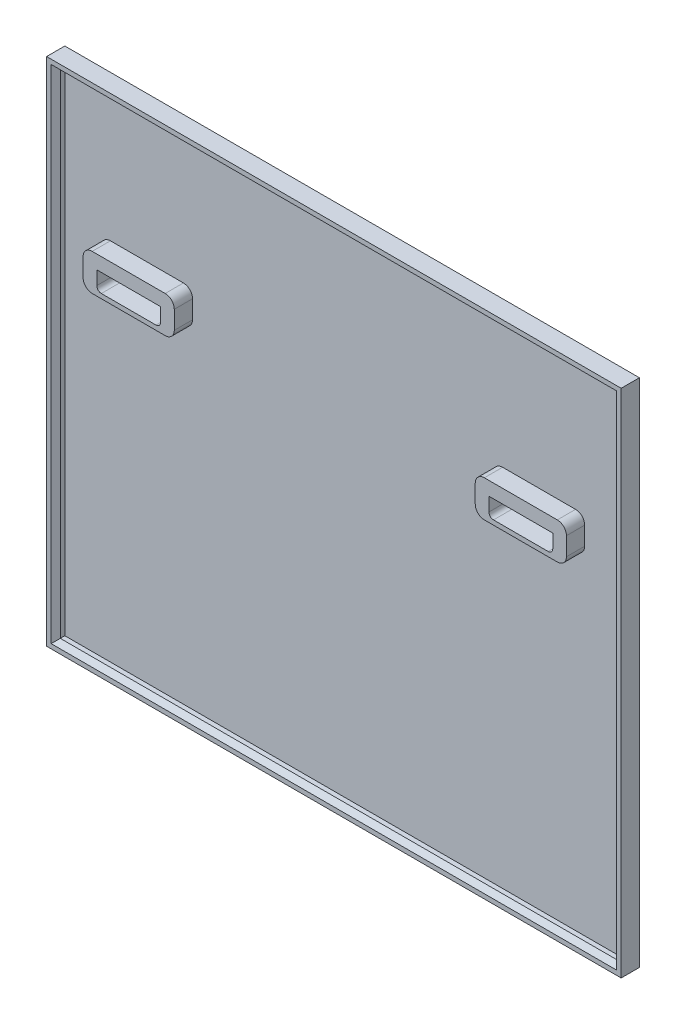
ISO-10303-21;
HEADER;
FILE_DESCRIPTION(('STEP AP214'),'2;1');
FILE_NAME('part.step','',(''),(''),'','','');
FILE_SCHEMA(('AUTOMOTIVE_DESIGN { 1 0 10303 214 1 1 1 1 }'));
ENDSEC;
DATA;
#1=APPLICATION_CONTEXT('core data for automotive mechanical design processes');
#2=APPLICATION_PROTOCOL_DEFINITION('international standard','automotive_design',2000,#1);
#3=PRODUCT_CONTEXT('',#1,'mechanical');
#4=PRODUCT('Part','Part','',(#3));
#5=PRODUCT_RELATED_PRODUCT_CATEGORY('part','',(#4));
#6=PRODUCT_DEFINITION_FORMATION('','',#4);
#7=PRODUCT_DEFINITION_CONTEXT('part definition',#1,'design');
#8=PRODUCT_DEFINITION('design','',#6,#7);
#9=PRODUCT_DEFINITION_SHAPE('','',#8);
#10=(LENGTH_UNIT() NAMED_UNIT(*) SI_UNIT(.MILLI.,.METRE.));
#11=(NAMED_UNIT(*) PLANE_ANGLE_UNIT() SI_UNIT($,.RADIAN.));
#12=(NAMED_UNIT(*) SI_UNIT($,.STERADIAN.) SOLID_ANGLE_UNIT());
#13=UNCERTAINTY_MEASURE_WITH_UNIT(LENGTH_MEASURE(1.E-05),#10,'distance_accuracy_value','');
#14=(GEOMETRIC_REPRESENTATION_CONTEXT(3) GLOBAL_UNCERTAINTY_ASSIGNED_CONTEXT((#13)) GLOBAL_UNIT_ASSIGNED_CONTEXT((#10,
#11,#12)) REPRESENTATION_CONTEXT('',''));
#15=CARTESIAN_POINT('',(0.,0.,0.));
#16=DIRECTION('',(0.,0.,1.));
#17=DIRECTION('',(1.,0.,0.));
#18=AXIS2_PLACEMENT_3D('',#15,#16,#17);
#19=CARTESIAN_POINT('',(0.,-560.,10.));
#20=DIRECTION('',(0.,0.,1.));
#21=DIRECTION('',(1.,0.,0.));
#22=AXIS2_PLACEMENT_3D('',#19,#20,#21);
#23=PLANE('',#22);
#24=DIRECTION('',(0.,1.,0.));
#25=VECTOR('',#24,1.);
#26=CARTESIAN_POINT('',(150.,-160.,10.));
#27=LINE('',#26,#25);
#28=CARTESIAN_POINT('',(150.,-180.,10.));
#29=VERTEX_POINT('',#28);
#30=CARTESIAN_POINT('',(150.,-160.,10.));
#31=VERTEX_POINT('',#30);
#32=EDGE_CURVE('E480',#29,#31,#27,.T.);
#33=ORIENTED_EDGE('',*,*,#32,.F.);
#34=CARTESIAN_POINT('',(140.,-180.,10.));
#35=DIRECTION('',(0.,0.,1.));
#36=DIRECTION('',(-1.,0.,0.));
#37=AXIS2_PLACEMENT_3D('',#34,#35,#36);
#38=CIRCLE('',#37,9.99999999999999);
#39=CARTESIAN_POINT('',(140.,-190.,10.));
#40=VERTEX_POINT('',#39);
#41=EDGE_CURVE('E458',#40,#29,#38,.T.);
#42=ORIENTED_EDGE('',*,*,#41,.F.);
#43=DIRECTION('',(1.,0.,0.));
#44=VECTOR('',#43,1.);
#45=CARTESIAN_POINT('',(60.,-190.,10.));
#46=LINE('',#45,#44);
#47=CARTESIAN_POINT('',(60.,-190.,10.));
#48=VERTEX_POINT('',#47);
#49=EDGE_CURVE('E463',#48,#40,#46,.T.);
#50=ORIENTED_EDGE('',*,*,#49,.F.);
#51=CARTESIAN_POINT('',(60.,-180.,10.));
#52=DIRECTION('',(0.,0.,1.));
#53=DIRECTION('',(1.,0.,0.));
#54=AXIS2_PLACEMENT_3D('',#51,#52,#53);
#55=CIRCLE('',#54,10.);
#56=CARTESIAN_POINT('',(50.,-180.,10.));
#57=VERTEX_POINT('',#56);
#58=EDGE_CURVE('E490',#57,#48,#55,.T.);
#59=ORIENTED_EDGE('',*,*,#58,.F.);
#60=DIRECTION('',(0.,-1.,0.));
#61=VECTOR('',#60,1.);
#62=CARTESIAN_POINT('',(50.,-160.,10.));
#63=LINE('',#62,#61);
#64=CARTESIAN_POINT('',(50.,-160.,10.));
#65=VERTEX_POINT('',#64);
#66=EDGE_CURVE('E488',#65,#57,#63,.T.);
#67=ORIENTED_EDGE('',*,*,#66,.F.);
#68=CARTESIAN_POINT('',(60.,-160.,10.));
#69=DIRECTION('',(0.,0.,1.));
#70=DIRECTION('',(1.,0.,0.));
#71=AXIS2_PLACEMENT_3D('',#68,#69,#70);
#72=CIRCLE('',#71,10.);
#73=CARTESIAN_POINT('',(60.,-150.,10.));
#74=VERTEX_POINT('',#73);
#75=EDGE_CURVE('E486',#74,#65,#72,.T.);
#76=ORIENTED_EDGE('',*,*,#75,.F.);
#77=DIRECTION('',(-1.,0.,0.));
#78=VECTOR('',#77,1.);
#79=CARTESIAN_POINT('',(60.,-150.,10.));
#80=LINE('',#79,#78);
#81=CARTESIAN_POINT('',(140.,-150.,10.));
#82=VERTEX_POINT('',#81);
#83=EDGE_CURVE('E484',#82,#74,#80,.T.);
#84=ORIENTED_EDGE('',*,*,#83,.F.);
#85=CARTESIAN_POINT('',(140.,-160.,10.));
#86=DIRECTION('',(0.,0.,1.));
#87=DIRECTION('',(1.,0.,0.));
#88=AXIS2_PLACEMENT_3D('',#85,#86,#87);
#89=CIRCLE('',#88,10.);
#90=EDGE_CURVE('E482',#31,#82,#89,.T.);
#91=ORIENTED_EDGE('',*,*,#90,.F.);
#92=EDGE_LOOP('',(#33,#42,#50,#59,#67,#76,#84,#91));
#93=FACE_BOUND('',#92,.T.);
#94=DIRECTION('',(0.,-1.,0.));
#95=VECTOR('',#94,1.);
#96=CARTESIAN_POINT('',(10.,0.,10.));
#97=LINE('',#96,#95);
#98=CARTESIAN_POINT('',(10.,-10.,10.));
#99=VERTEX_POINT('',#98);
#100=CARTESIAN_POINT('',(10.0000000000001,-550.,10.));
#101=VERTEX_POINT('',#100);
#102=EDGE_CURVE('E548',#99,#101,#97,.T.);
#103=ORIENTED_EDGE('',*,*,#102,.T.);
#104=DIRECTION('',(1.,0.,0.));
#105=VECTOR('',#104,1.);
#106=CARTESIAN_POINT('',(0.,-550.,10.));
#107=LINE('',#106,#105);
#108=CARTESIAN_POINT('',(620.,-550.,10.));
#109=VERTEX_POINT('',#108);
#110=EDGE_CURVE('E551',#101,#109,#107,.T.);
#111=ORIENTED_EDGE('',*,*,#110,.T.);
#112=DIRECTION('',(0.,1.,0.));
#113=VECTOR('',#112,1.);
#114=CARTESIAN_POINT('',(620.,0.,10.));
#115=LINE('',#114,#113);
#116=CARTESIAN_POINT('',(620.,-10.,10.));
#117=VERTEX_POINT('',#116);
#118=EDGE_CURVE('E562',#109,#117,#115,.T.);
#119=ORIENTED_EDGE('',*,*,#118,.T.);
#120=DIRECTION('',(-1.,0.,0.));
#121=VECTOR('',#120,1.);
#122=CARTESIAN_POINT('',(0.,-10.,10.));
#123=LINE('',#122,#121);
#124=EDGE_CURVE('E559',#117,#99,#123,.T.);
#125=ORIENTED_EDGE('',*,*,#124,.T.);
#126=EDGE_LOOP('',(#103,#111,#119,#125));
#127=FACE_BOUND('',#126,.T.);
#128=DIRECTION('',(0.,1.,0.));
#129=VECTOR('',#128,1.);
#130=CARTESIAN_POINT('',(580.,-160.,10.));
#131=LINE('',#130,#129);
#132=CARTESIAN_POINT('',(580.,-180.,10.));
#133=VERTEX_POINT('',#132);
#134=CARTESIAN_POINT('',(580.,-160.,10.));
#135=VERTEX_POINT('',#134);
#136=EDGE_CURVE('E423',#133,#135,#131,.T.);
#137=ORIENTED_EDGE('',*,*,#136,.F.);
#138=CARTESIAN_POINT('',(570.,-180.,10.));
#139=DIRECTION('',(0.,0.,1.));
#140=DIRECTION('',(-1.,0.,0.));
#141=AXIS2_PLACEMENT_3D('',#138,#139,#140);
#142=CIRCLE('',#141,9.99999999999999);
#143=CARTESIAN_POINT('',(570.,-190.,10.));
#144=VERTEX_POINT('',#143);
#145=EDGE_CURVE('E392',#144,#133,#142,.T.);
#146=ORIENTED_EDGE('',*,*,#145,.F.);
#147=DIRECTION('',(1.,0.,0.));
#148=VECTOR('',#147,1.);
#149=CARTESIAN_POINT('',(490.,-190.,10.));
#150=LINE('',#149,#148);
#151=CARTESIAN_POINT('',(490.,-190.,10.));
#152=VERTEX_POINT('',#151);
#153=EDGE_CURVE('E406',#152,#144,#150,.T.);
#154=ORIENTED_EDGE('',*,*,#153,.F.);
#155=CARTESIAN_POINT('',(490.,-180.,10.));
#156=DIRECTION('',(0.,0.,1.));
#157=DIRECTION('',(1.,0.,0.));
#158=AXIS2_PLACEMENT_3D('',#155,#156,#157);
#159=CIRCLE('',#158,9.99999999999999);
#160=CARTESIAN_POINT('',(480.,-180.,10.));
#161=VERTEX_POINT('',#160);
#162=EDGE_CURVE('E433',#161,#152,#159,.T.);
#163=ORIENTED_EDGE('',*,*,#162,.F.);
#164=DIRECTION('',(0.,-1.,0.));
#165=VECTOR('',#164,1.);
#166=CARTESIAN_POINT('',(480.,-160.,10.));
#167=LINE('',#166,#165);
#168=CARTESIAN_POINT('',(480.,-160.,10.));
#169=VERTEX_POINT('',#168);
#170=EDGE_CURVE('E431',#169,#161,#167,.T.);
#171=ORIENTED_EDGE('',*,*,#170,.F.);
#172=CARTESIAN_POINT('',(490.,-160.,10.));
#173=DIRECTION('',(0.,0.,1.));
#174=DIRECTION('',(-1.,0.,0.));
#175=AXIS2_PLACEMENT_3D('',#172,#173,#174);
#176=CIRCLE('',#175,10.);
#177=CARTESIAN_POINT('',(490.,-150.,10.));
#178=VERTEX_POINT('',#177);
#179=EDGE_CURVE('E429',#178,#169,#176,.T.);
#180=ORIENTED_EDGE('',*,*,#179,.F.);
#181=DIRECTION('',(-1.,0.,0.));
#182=VECTOR('',#181,1.);
#183=CARTESIAN_POINT('',(490.,-150.,10.));
#184=LINE('',#183,#182);
#185=CARTESIAN_POINT('',(570.,-150.,10.));
#186=VERTEX_POINT('',#185);
#187=EDGE_CURVE('E427',#186,#178,#184,.T.);
#188=ORIENTED_EDGE('',*,*,#187,.F.);
#189=CARTESIAN_POINT('',(570.,-160.,10.));
#190=DIRECTION('',(0.,0.,1.));
#191=DIRECTION('',(1.,0.,0.));
#192=AXIS2_PLACEMENT_3D('',#189,#190,#191);
#193=CIRCLE('',#192,10.);
#194=EDGE_CURVE('E425',#135,#186,#193,.T.);
#195=ORIENTED_EDGE('',*,*,#194,.F.);
#196=EDGE_LOOP('',(#137,#146,#154,#163,#171,#180,#188,#195));
#197=FACE_BOUND('',#196,.T.);
#198=ADVANCED_FACE('F31',(#93,#127,#197),#23,.T.);
#199=CARTESIAN_POINT('',(0.,0.,20.));
#200=DIRECTION('',(1.,0.,0.));
#201=DIRECTION('',(0.,1.,0.));
#202=AXIS2_PLACEMENT_3D('',#199,#200,#201);
#203=PLANE('',#202);
#204=DIRECTION('',(0.,-1.,0.));
#205=VECTOR('',#204,1.);
#206=CARTESIAN_POINT('',(0.,0.,0.));
#207=LINE('',#206,#205);
#208=CARTESIAN_POINT('',(0.,0.,0.));
#209=VERTEX_POINT('',#208);
#210=CARTESIAN_POINT('',(0.,-560.,0.));
#211=VERTEX_POINT('',#210);
#212=EDGE_CURVE('E554',#209,#211,#207,.T.);
#213=ORIENTED_EDGE('',*,*,#212,.T.);
#214=DIRECTION('',(0.,0.,-1.));
#215=VECTOR('',#214,1.);
#216=CARTESIAN_POINT('',(0.,-560.,20.));
#217=LINE('',#216,#215);
#218=CARTESIAN_POINT('',(0.,-560.,20.));
#219=VERTEX_POINT('',#218);
#220=EDGE_CURVE('E595',#219,#211,#217,.T.);
#221=ORIENTED_EDGE('',*,*,#220,.F.);
#222=DIRECTION('',(0.,-1.,0.));
#223=VECTOR('',#222,1.);
#224=CARTESIAN_POINT('',(0.,0.,20.));
#225=LINE('',#224,#223);
#226=CARTESIAN_POINT('',(0.,0.,20.));
#227=VERTEX_POINT('',#226);
#228=EDGE_CURVE('E569',#227,#219,#225,.T.);
#229=ORIENTED_EDGE('',*,*,#228,.F.);
#230=DIRECTION('',(0.,0.,-1.));
#231=VECTOR('',#230,1.);
#232=CARTESIAN_POINT('',(0.,0.,20.));
#233=LINE('',#232,#231);
#234=EDGE_CURVE('E579',#227,#209,#233,.T.);
#235=ORIENTED_EDGE('',*,*,#234,.T.);
#236=EDGE_LOOP('',(#213,#221,#229,#235));
#237=FACE_BOUND('',#236,.T.);
#238=ADVANCED_FACE('F670',(#237),#203,.F.);
#239=CARTESIAN_POINT('',(0.,-560.,20.));
#240=DIRECTION('',(0.,1.,0.));
#241=DIRECTION('',(0.,0.,1.));
#242=AXIS2_PLACEMENT_3D('',#239,#240,#241);
#243=PLANE('',#242);
#244=DIRECTION('',(1.,0.,0.));
#245=VECTOR('',#244,1.);
#246=CARTESIAN_POINT('',(0.,-560.,0.));
#247=LINE('',#246,#245);
#248=CARTESIAN_POINT('',(630.,-560.,0.));
#249=VERTEX_POINT('',#248);
#250=EDGE_CURVE('E582',#211,#249,#247,.T.);
#251=ORIENTED_EDGE('',*,*,#250,.T.);
#252=DIRECTION('',(0.,0.,-1.));
#253=VECTOR('',#252,1.);
#254=CARTESIAN_POINT('',(630.,-560.,20.));
#255=LINE('',#254,#253);
#256=CARTESIAN_POINT('',(630.,-560.,20.));
#257=VERTEX_POINT('',#256);
#258=EDGE_CURVE('E592',#257,#249,#255,.T.);
#259=ORIENTED_EDGE('',*,*,#258,.F.);
#260=DIRECTION('',(1.,0.,0.));
#261=VECTOR('',#260,1.);
#262=CARTESIAN_POINT('',(0.,-560.,20.));
#263=LINE('',#262,#261);
#264=EDGE_CURVE('E572',#219,#257,#263,.T.);
#265=ORIENTED_EDGE('',*,*,#264,.F.);
#266=ORIENTED_EDGE('',*,*,#220,.T.);
#267=EDGE_LOOP('',(#251,#259,#265,#266));
#268=FACE_BOUND('',#267,.T.);
#269=ADVANCED_FACE('F676',(#268),#243,.F.);
#270=CARTESIAN_POINT('',(630.,0.,20.));
#271=DIRECTION('',(-1.,0.,0.));
#272=DIRECTION('',(0.,-1.,0.));
#273=AXIS2_PLACEMENT_3D('',#270,#271,#272);
#274=PLANE('',#273);
#275=DIRECTION('',(0.,1.,0.));
#276=VECTOR('',#275,1.);
#277=CARTESIAN_POINT('',(630.,0.,0.));
#278=LINE('',#277,#276);
#279=CARTESIAN_POINT('',(630.,0.,0.));
#280=VERTEX_POINT('',#279);
#281=EDGE_CURVE('E584',#249,#280,#278,.T.);
#282=ORIENTED_EDGE('',*,*,#281,.T.);
#283=DIRECTION('',(0.,0.,-1.));
#284=VECTOR('',#283,1.);
#285=CARTESIAN_POINT('',(630.,0.,20.));
#286=LINE('',#285,#284);
#287=CARTESIAN_POINT('',(630.,0.,20.));
#288=VERTEX_POINT('',#287);
#289=EDGE_CURVE('E589',#288,#280,#286,.T.);
#290=ORIENTED_EDGE('',*,*,#289,.F.);
#291=DIRECTION('',(0.,1.,0.));
#292=VECTOR('',#291,1.);
#293=CARTESIAN_POINT('',(630.,0.,20.));
#294=LINE('',#293,#292);
#295=EDGE_CURVE('E575',#257,#288,#294,.T.);
#296=ORIENTED_EDGE('',*,*,#295,.F.);
#297=ORIENTED_EDGE('',*,*,#258,.T.);
#298=EDGE_LOOP('',(#282,#290,#296,#297));
#299=FACE_BOUND('',#298,.T.);
#300=ADVANCED_FACE('F688',(#299),#274,.F.);
#301=CARTESIAN_POINT('',(0.,0.,20.));
#302=DIRECTION('',(0.,-1.,0.));
#303=DIRECTION('',(0.,0.,-1.));
#304=AXIS2_PLACEMENT_3D('',#301,#302,#303);
#305=PLANE('',#304);
#306=DIRECTION('',(-1.,0.,0.));
#307=VECTOR('',#306,1.);
#308=CARTESIAN_POINT('',(0.,0.,0.));
#309=LINE('',#308,#307);
#310=EDGE_CURVE('E573',#280,#209,#309,.T.);
#311=ORIENTED_EDGE('',*,*,#310,.T.);
#312=ORIENTED_EDGE('',*,*,#234,.F.);
#313=DIRECTION('',(-1.,0.,0.));
#314=VECTOR('',#313,1.);
#315=CARTESIAN_POINT('',(0.,0.,20.));
#316=LINE('',#315,#314);
#317=EDGE_CURVE('E577',#288,#227,#316,.T.);
#318=ORIENTED_EDGE('',*,*,#317,.F.);
#319=ORIENTED_EDGE('',*,*,#289,.T.);
#320=EDGE_LOOP('',(#311,#312,#318,#319));
#321=FACE_BOUND('',#320,.T.);
#322=ADVANCED_FACE('F684',(#321),#305,.F.);
#323=CARTESIAN_POINT('',(0.,-560.,20.));
#324=DIRECTION('',(0.,0.,1.));
#325=DIRECTION('',(1.,0.,0.));
#326=AXIS2_PLACEMENT_3D('',#323,#324,#325);
#327=PLANE('',#326);
#328=DIRECTION('',(0.,-1.,0.));
#329=VECTOR('',#328,1.);
#330=CARTESIAN_POINT('',(625.,-560.,20.));
#331=LINE('',#330,#329);
#332=CARTESIAN_POINT('',(625.,-5.,20.));
#333=VERTEX_POINT('',#332);
#334=CARTESIAN_POINT('',(625.,-555.,20.));
#335=VERTEX_POINT('',#334);
#336=EDGE_CURVE('E605',#333,#335,#331,.T.);
#337=ORIENTED_EDGE('',*,*,#336,.T.);
#338=DIRECTION('',(-1.,0.,0.));
#339=VECTOR('',#338,1.);
#340=CARTESIAN_POINT('',(0.,-555.,20.));
#341=LINE('',#340,#339);
#342=CARTESIAN_POINT('',(5.00000000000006,-555.,20.));
#343=VERTEX_POINT('',#342);
#344=EDGE_CURVE('E607',#335,#343,#341,.T.);
#345=ORIENTED_EDGE('',*,*,#344,.T.);
#346=DIRECTION('',(0.,1.,0.));
#347=VECTOR('',#346,1.);
#348=CARTESIAN_POINT('',(5.00000000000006,-560.,20.));
#349=LINE('',#348,#347);
#350=CARTESIAN_POINT('',(5.,-5.,20.));
#351=VERTEX_POINT('',#350);
#352=EDGE_CURVE('E603',#343,#351,#349,.T.);
#353=ORIENTED_EDGE('',*,*,#352,.T.);
#354=DIRECTION('',(1.,0.,0.));
#355=VECTOR('',#354,1.);
#356=CARTESIAN_POINT('',(0.,-5.,20.));
#357=LINE('',#356,#355);
#358=EDGE_CURVE('E601',#351,#333,#357,.T.);
#359=ORIENTED_EDGE('',*,*,#358,.T.);
#360=EDGE_LOOP('',(#337,#345,#353,#359));
#361=FACE_BOUND('',#360,.T.);
#362=ORIENTED_EDGE('',*,*,#228,.T.);
#363=ORIENTED_EDGE('',*,*,#264,.T.);
#364=ORIENTED_EDGE('',*,*,#295,.T.);
#365=ORIENTED_EDGE('',*,*,#317,.T.);
#366=EDGE_LOOP('',(#362,#363,#364,#365));
#367=FACE_BOUND('',#366,.T.);
#368=ADVANCED_FACE('F632',(#361,#367),#327,.T.);
#369=CARTESIAN_POINT('',(0.,-560.,0.));
#370=DIRECTION('',(0.,0.,1.));
#371=DIRECTION('',(1.,0.,0.));
#372=AXIS2_PLACEMENT_3D('',#369,#370,#371);
#373=PLANE('',#372);
#374=DIRECTION('',(-1.,0.,0.));
#375=VECTOR('',#374,1.);
#376=CARTESIAN_POINT('',(0.,-10.,0.));
#377=LINE('',#376,#375);
#378=CARTESIAN_POINT('',(620.,-10.,0.));
#379=VERTEX_POINT('',#378);
#380=CARTESIAN_POINT('',(10.,-10.,0.));
#381=VERTEX_POINT('',#380);
#382=EDGE_CURVE('E523',#379,#381,#377,.T.);
#383=ORIENTED_EDGE('',*,*,#382,.T.);
#384=DIRECTION('',(0.,-1.,0.));
#385=VECTOR('',#384,1.);
#386=CARTESIAN_POINT('',(10.,0.,0.));
#387=LINE('',#386,#385);
#388=CARTESIAN_POINT('',(10.0000000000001,-550.,0.));
#389=VERTEX_POINT('',#388);
#390=EDGE_CURVE('E527',#381,#389,#387,.T.);
#391=ORIENTED_EDGE('',*,*,#390,.T.);
#392=DIRECTION('',(1.,0.,0.));
#393=VECTOR('',#392,1.);
#394=CARTESIAN_POINT('',(0.,-550.,0.));
#395=LINE('',#394,#393);
#396=CARTESIAN_POINT('',(620.,-550.,0.));
#397=VERTEX_POINT('',#396);
#398=EDGE_CURVE('E530',#389,#397,#395,.T.);
#399=ORIENTED_EDGE('',*,*,#398,.T.);
#400=DIRECTION('',(0.,1.,0.));
#401=VECTOR('',#400,1.);
#402=CARTESIAN_POINT('',(620.,0.,0.));
#403=LINE('',#402,#401);
#404=EDGE_CURVE('E533',#397,#379,#403,.T.);
#405=ORIENTED_EDGE('',*,*,#404,.T.);
#406=EDGE_LOOP('',(#383,#391,#399,#405));
#407=FACE_BOUND('',#406,.T.);
#408=ORIENTED_EDGE('',*,*,#212,.F.);
#409=ORIENTED_EDGE('',*,*,#310,.F.);
#410=ORIENTED_EDGE('',*,*,#281,.F.);
#411=ORIENTED_EDGE('',*,*,#250,.F.);
#412=EDGE_LOOP('',(#408,#409,#410,#411));
#413=FACE_BOUND('',#412,.T.);
#414=ADVANCED_FACE('F659',(#407,#413),#373,.F.);
#415=CARTESIAN_POINT('',(10.,0.,20.));
#416=DIRECTION('',(1.,0.,0.));
#417=DIRECTION('',(0.,1.,0.));
#418=AXIS2_PLACEMENT_3D('',#415,#416,#417);
#419=PLANE('',#418);
#420=DIRECTION('',(0.,0.,-1.));
#421=VECTOR('',#420,1.);
#422=CARTESIAN_POINT('',(10.,-10.,20.));
#423=LINE('',#422,#421);
#424=CARTESIAN_POINT('',(10.,-10.,15.));
#425=VERTEX_POINT('',#424);
#426=EDGE_CURVE('E556',#425,#99,#423,.T.);
#427=ORIENTED_EDGE('',*,*,#426,.F.);
#428=DIRECTION('',(0.,-1.,0.));
#429=VECTOR('',#428,1.);
#430=CARTESIAN_POINT('',(10.,0.,15.));
#431=LINE('',#430,#429);
#432=CARTESIAN_POINT('',(10.0000000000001,-550.,15.));
#433=VERTEX_POINT('',#432);
#434=EDGE_CURVE('E40',#425,#433,#431,.T.);
#435=ORIENTED_EDGE('',*,*,#434,.T.);
#436=DIRECTION('',(0.,0.,-1.));
#437=VECTOR('',#436,1.);
#438=CARTESIAN_POINT('',(10.0000000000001,-550.,20.));
#439=LINE('',#438,#437);
#440=EDGE_CURVE('E552',#433,#101,#439,.T.);
#441=ORIENTED_EDGE('',*,*,#440,.T.);
#442=ORIENTED_EDGE('',*,*,#102,.F.);
#443=EDGE_LOOP('',(#427,#435,#441,#442));
#444=FACE_BOUND('',#443,.T.);
#445=ADVANCED_FACE('F657',(#444),#419,.T.);
#446=CARTESIAN_POINT('',(0.,-550.,20.));
#447=DIRECTION('',(0.,1.,0.));
#448=DIRECTION('',(0.,0.,1.));
#449=AXIS2_PLACEMENT_3D('',#446,#447,#448);
#450=PLANE('',#449);
#451=ORIENTED_EDGE('',*,*,#440,.F.);
#452=DIRECTION('',(1.,0.,0.));
#453=VECTOR('',#452,1.);
#454=CARTESIAN_POINT('',(0.,-550.,15.));
#455=LINE('',#454,#453);
#456=CARTESIAN_POINT('',(620.,-550.,15.));
#457=VERTEX_POINT('',#456);
#458=EDGE_CURVE('E598',#433,#457,#455,.T.);
#459=ORIENTED_EDGE('',*,*,#458,.T.);
#460=DIRECTION('',(0.,0.,-1.));
#461=VECTOR('',#460,1.);
#462=CARTESIAN_POINT('',(620.,-550.,20.));
#463=LINE('',#462,#461);
#464=EDGE_CURVE('E555',#457,#109,#463,.T.);
#465=ORIENTED_EDGE('',*,*,#464,.T.);
#466=ORIENTED_EDGE('',*,*,#110,.F.);
#467=EDGE_LOOP('',(#451,#459,#465,#466));
#468=FACE_BOUND('',#467,.T.);
#469=ADVANCED_FACE('F645',(#468),#450,.T.);
#470=CARTESIAN_POINT('',(620.,0.,20.));
#471=DIRECTION('',(-1.,0.,0.));
#472=DIRECTION('',(0.,-1.,0.));
#473=AXIS2_PLACEMENT_3D('',#470,#471,#472);
#474=PLANE('',#473);
#475=ORIENTED_EDGE('',*,*,#464,.F.);
#476=DIRECTION('',(0.,1.,0.));
#477=VECTOR('',#476,1.);
#478=CARTESIAN_POINT('',(620.,0.,15.));
#479=LINE('',#478,#477);
#480=CARTESIAN_POINT('',(620.,-10.,15.));
#481=VERTEX_POINT('',#480);
#482=EDGE_CURVE('E610',#457,#481,#479,.T.);
#483=ORIENTED_EDGE('',*,*,#482,.T.);
#484=DIRECTION('',(0.,0.,-1.));
#485=VECTOR('',#484,1.);
#486=CARTESIAN_POINT('',(620.,-10.,20.));
#487=LINE('',#486,#485);
#488=EDGE_CURVE('E558',#481,#117,#487,.T.);
#489=ORIENTED_EDGE('',*,*,#488,.T.);
#490=ORIENTED_EDGE('',*,*,#118,.F.);
#491=EDGE_LOOP('',(#475,#483,#489,#490));
#492=FACE_BOUND('',#491,.T.);
#493=ADVANCED_FACE('F648',(#492),#474,.T.);
#494=CARTESIAN_POINT('',(0.,-10.,20.));
#495=DIRECTION('',(0.,-1.,0.));
#496=DIRECTION('',(0.,0.,-1.));
#497=AXIS2_PLACEMENT_3D('',#494,#495,#496);
#498=PLANE('',#497);
#499=ORIENTED_EDGE('',*,*,#488,.F.);
#500=DIRECTION('',(-1.,0.,0.));
#501=VECTOR('',#500,1.);
#502=CARTESIAN_POINT('',(0.,-10.,15.));
#503=LINE('',#502,#501);
#504=EDGE_CURVE('E11',#481,#425,#503,.T.);
#505=ORIENTED_EDGE('',*,*,#504,.T.);
#506=ORIENTED_EDGE('',*,*,#426,.T.);
#507=ORIENTED_EDGE('',*,*,#124,.F.);
#508=EDGE_LOOP('',(#499,#505,#506,#507));
#509=FACE_BOUND('',#508,.T.);
#510=ADVANCED_FACE('F654',(#509),#498,.T.);
#511=CARTESIAN_POINT('',(0.,-560.,2.));
#512=DIRECTION('',(0.,0.,1.));
#513=DIRECTION('',(1.,0.,0.));
#514=AXIS2_PLACEMENT_3D('',#511,#512,#513);
#515=PLANE('',#514);
#516=DIRECTION('',(0.,1.,0.));
#517=VECTOR('',#516,1.);
#518=CARTESIAN_POINT('',(620.,0.,2.));
#519=LINE('',#518,#517);
#520=CARTESIAN_POINT('',(620.,-550.,2.));
#521=VERTEX_POINT('',#520);
#522=CARTESIAN_POINT('',(620.,-10.,2.));
#523=VERTEX_POINT('',#522);
#524=EDGE_CURVE('E543',#521,#523,#519,.T.);
#525=ORIENTED_EDGE('',*,*,#524,.F.);
#526=DIRECTION('',(1.,0.,0.));
#527=VECTOR('',#526,1.);
#528=CARTESIAN_POINT('',(0.,-550.,2.));
#529=LINE('',#528,#527);
#530=CARTESIAN_POINT('',(10.0000000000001,-550.,2.));
#531=VERTEX_POINT('',#530);
#532=EDGE_CURVE('E540',#531,#521,#529,.T.);
#533=ORIENTED_EDGE('',*,*,#532,.F.);
#534=DIRECTION('',(0.,-1.,0.));
#535=VECTOR('',#534,1.);
#536=CARTESIAN_POINT('',(10.,0.,2.));
#537=LINE('',#536,#535);
#538=CARTESIAN_POINT('',(10.,-10.,2.));
#539=VERTEX_POINT('',#538);
#540=EDGE_CURVE('E518',#539,#531,#537,.T.);
#541=ORIENTED_EDGE('',*,*,#540,.F.);
#542=DIRECTION('',(-1.,0.,0.));
#543=VECTOR('',#542,1.);
#544=CARTESIAN_POINT('',(0.,-10.,2.));
#545=LINE('',#544,#543);
#546=EDGE_CURVE('E546',#523,#539,#545,.T.);
#547=ORIENTED_EDGE('',*,*,#546,.F.);
#548=EDGE_LOOP('',(#525,#533,#541,#547));
#549=FACE_BOUND('',#548,.T.);
#550=ADVANCED_FACE('F718',(#549),#515,.F.);
#551=CARTESIAN_POINT('',(10.,0.,20.));
#552=DIRECTION('',(1.,0.,0.));
#553=DIRECTION('',(0.,1.,0.));
#554=AXIS2_PLACEMENT_3D('',#551,#552,#553);
#555=PLANE('',#554);
#556=ORIENTED_EDGE('',*,*,#540,.T.);
#557=DIRECTION('',(0.,0.,-1.));
#558=VECTOR('',#557,1.);
#559=CARTESIAN_POINT('',(10.0000000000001,-550.,20.));
#560=LINE('',#559,#558);
#561=EDGE_CURVE('E516',#531,#389,#560,.T.);
#562=ORIENTED_EDGE('',*,*,#561,.T.);
#563=ORIENTED_EDGE('',*,*,#390,.F.);
#564=DIRECTION('',(0.,0.,-1.));
#565=VECTOR('',#564,1.);
#566=CARTESIAN_POINT('',(10.,-10.,20.));
#567=LINE('',#566,#565);
#568=EDGE_CURVE('E520',#539,#381,#567,.T.);
#569=ORIENTED_EDGE('',*,*,#568,.F.);
#570=EDGE_LOOP('',(#556,#562,#563,#569));
#571=FACE_BOUND('',#570,.T.);
#572=ADVANCED_FACE('F720',(#571),#555,.T.);
#573=CARTESIAN_POINT('',(0.,-550.,20.));
#574=DIRECTION('',(0.,1.,0.));
#575=DIRECTION('',(0.,0.,1.));
#576=AXIS2_PLACEMENT_3D('',#573,#574,#575);
#577=PLANE('',#576);
#578=ORIENTED_EDGE('',*,*,#532,.T.);
#579=DIRECTION('',(0.,0.,-1.));
#580=VECTOR('',#579,1.);
#581=CARTESIAN_POINT('',(620.,-550.,20.));
#582=LINE('',#581,#580);
#583=EDGE_CURVE('E519',#521,#397,#582,.T.);
#584=ORIENTED_EDGE('',*,*,#583,.T.);
#585=ORIENTED_EDGE('',*,*,#398,.F.);
#586=ORIENTED_EDGE('',*,*,#561,.F.);
#587=EDGE_LOOP('',(#578,#584,#585,#586));
#588=FACE_BOUND('',#587,.T.);
#589=ADVANCED_FACE('F714',(#588),#577,.T.);
#590=CARTESIAN_POINT('',(620.,0.,20.));
#591=DIRECTION('',(-1.,0.,0.));
#592=DIRECTION('',(0.,-1.,0.));
#593=AXIS2_PLACEMENT_3D('',#590,#591,#592);
#594=PLANE('',#593);
#595=ORIENTED_EDGE('',*,*,#524,.T.);
#596=DIRECTION('',(0.,0.,-1.));
#597=VECTOR('',#596,1.);
#598=CARTESIAN_POINT('',(620.,-10.,20.));
#599=LINE('',#598,#597);
#600=EDGE_CURVE('E522',#523,#379,#599,.T.);
#601=ORIENTED_EDGE('',*,*,#600,.T.);
#602=ORIENTED_EDGE('',*,*,#404,.F.);
#603=ORIENTED_EDGE('',*,*,#583,.F.);
#604=EDGE_LOOP('',(#595,#601,#602,#603));
#605=FACE_BOUND('',#604,.T.);
#606=ADVANCED_FACE('F708',(#605),#594,.T.);
#607=CARTESIAN_POINT('',(0.,-10.,20.));
#608=DIRECTION('',(0.,-1.,0.));
#609=DIRECTION('',(0.,0.,-1.));
#610=AXIS2_PLACEMENT_3D('',#607,#608,#609);
#611=PLANE('',#610);
#612=ORIENTED_EDGE('',*,*,#546,.T.);
#613=ORIENTED_EDGE('',*,*,#568,.T.);
#614=ORIENTED_EDGE('',*,*,#382,.F.);
#615=ORIENTED_EDGE('',*,*,#600,.F.);
#616=EDGE_LOOP('',(#612,#613,#614,#615));
#617=FACE_BOUND('',#616,.T.);
#618=ADVANCED_FACE('F704',(#617),#611,.T.);
#619=CARTESIAN_POINT('',(0.,-10.,15.));
#620=DIRECTION('',(0.,0.707106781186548,-0.707106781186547));
#621=DIRECTION('',(0.,0.707106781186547,0.707106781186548));
#622=AXIS2_PLACEMENT_3D('',#619,#620,#621);
#623=PLANE('',#622);
#624=DIRECTION('',(0.577350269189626,0.577350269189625,0.577350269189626));
#625=VECTOR('',#624,1.);
#626=CARTESIAN_POINT('',(623.333333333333,-6.66666666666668,18.3333333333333));
#627=LINE('',#626,#625);
#628=EDGE_CURVE('E615',#333,#481,#627,.F.);
#629=ORIENTED_EDGE('',*,*,#628,.F.);
#630=ORIENTED_EDGE('',*,*,#358,.F.);
#631=DIRECTION('',(0.577350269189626,-0.577350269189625,-0.577350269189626));
#632=VECTOR('',#631,1.);
#633=CARTESIAN_POINT('',(6.66666666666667,-6.66666666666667,18.3333333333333));
#634=LINE('',#633,#632);
#635=EDGE_CURVE('E35',#425,#351,#634,.F.);
#636=ORIENTED_EDGE('',*,*,#635,.F.);
#637=ORIENTED_EDGE('',*,*,#504,.F.);
#638=EDGE_LOOP('',(#629,#630,#636,#637));
#639=FACE_BOUND('',#638,.T.);
#640=ADVANCED_FACE('F33',(#639),#623,.F.);
#641=CARTESIAN_POINT('',(10.,0.,15.));
#642=DIRECTION('',(-0.707106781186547,0.,-0.707106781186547));
#643=DIRECTION('',(-0.707106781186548,0.,0.707106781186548));
#644=AXIS2_PLACEMENT_3D('',#641,#642,#643);
#645=PLANE('',#644);
#646=ORIENTED_EDGE('',*,*,#635,.T.);
#647=ORIENTED_EDGE('',*,*,#352,.F.);
#648=DIRECTION('',(0.577350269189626,0.577350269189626,-0.577350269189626));
#649=VECTOR('',#648,1.);
#650=CARTESIAN_POINT('',(6.66666666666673,-553.333333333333,18.3333333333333));
#651=LINE('',#650,#649);
#652=EDGE_CURVE('E614',#433,#343,#651,.F.);
#653=ORIENTED_EDGE('',*,*,#652,.F.);
#654=ORIENTED_EDGE('',*,*,#434,.F.);
#655=EDGE_LOOP('',(#646,#647,#653,#654));
#656=FACE_BOUND('',#655,.T.);
#657=ADVANCED_FACE('F626',(#656),#645,.F.);
#658=CARTESIAN_POINT('',(620.,0.,15.));
#659=DIRECTION('',(0.707106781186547,0.,-0.707106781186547));
#660=DIRECTION('',(-0.707106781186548,0.,-0.707106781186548));
#661=AXIS2_PLACEMENT_3D('',#658,#659,#660);
#662=PLANE('',#661);
#663=ORIENTED_EDGE('',*,*,#628,.T.);
#664=ORIENTED_EDGE('',*,*,#482,.F.);
#665=DIRECTION('',(0.577350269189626,-0.577350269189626,0.577350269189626));
#666=VECTOR('',#665,1.);
#667=CARTESIAN_POINT('',(413.333333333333,-343.333333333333,-191.666666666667));
#668=LINE('',#667,#666);
#669=EDGE_CURVE('E515',#335,#457,#668,.F.);
#670=ORIENTED_EDGE('',*,*,#669,.F.);
#671=ORIENTED_EDGE('',*,*,#336,.F.);
#672=EDGE_LOOP('',(#663,#664,#670,#671));
#673=FACE_BOUND('',#672,.T.);
#674=ADVANCED_FACE('F639',(#673),#662,.F.);
#675=CARTESIAN_POINT('',(0.,-550.,15.));
#676=DIRECTION('',(0.,-0.707106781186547,-0.707106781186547));
#677=DIRECTION('',(0.,0.707106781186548,-0.707106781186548));
#678=AXIS2_PLACEMENT_3D('',#675,#676,#677);
#679=PLANE('',#678);
#680=ORIENTED_EDGE('',*,*,#652,.T.);
#681=ORIENTED_EDGE('',*,*,#344,.F.);
#682=ORIENTED_EDGE('',*,*,#669,.T.);
#683=ORIENTED_EDGE('',*,*,#458,.F.);
#684=EDGE_LOOP('',(#680,#681,#682,#683));
#685=FACE_BOUND('',#684,.T.);
#686=ADVANCED_FACE('F637',(#685),#679,.F.);
#687=CARTESIAN_POINT('',(140.,-180.,30.));
#688=DIRECTION('',(0.,0.,-1.));
#689=DIRECTION('',(-1.,0.,0.));
#690=AXIS2_PLACEMENT_3D('',#687,#688,#689);
#691=CYLINDRICAL_SURFACE('',#690,9.99999999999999);
#692=ORIENTED_EDGE('',*,*,#41,.T.);
#693=DIRECTION('',(0.,0.,-1.));
#694=VECTOR('',#693,1.);
#695=CARTESIAN_POINT('',(150.,-180.,30.));
#696=LINE('',#695,#694);
#697=CARTESIAN_POINT('',(150.,-180.,30.));
#698=VERTEX_POINT('',#697);
#699=EDGE_CURVE('E513',#698,#29,#696,.T.);
#700=ORIENTED_EDGE('',*,*,#699,.F.);
#701=CARTESIAN_POINT('',(140.,-180.,30.));
#702=DIRECTION('',(0.,0.,1.));
#703=DIRECTION('',(-1.,0.,0.));
#704=AXIS2_PLACEMENT_3D('',#701,#702,#703);
#705=CIRCLE('',#704,9.99999999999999);
#706=CARTESIAN_POINT('',(140.,-190.,30.));
#707=VERTEX_POINT('',#706);
#708=EDGE_CURVE('E459',#707,#698,#705,.T.);
#709=ORIENTED_EDGE('',*,*,#708,.F.);
#710=DIRECTION('',(0.,0.,-1.));
#711=VECTOR('',#710,1.);
#712=CARTESIAN_POINT('',(140.,-190.,30.));
#713=LINE('',#712,#711);
#714=EDGE_CURVE('E477',#707,#40,#713,.T.);
#715=ORIENTED_EDGE('',*,*,#714,.T.);
#716=EDGE_LOOP('',(#692,#700,#709,#715));
#717=FACE_BOUND('',#716,.T.);
#718=ADVANCED_FACE('F698',(#717),#691,.T.);
#719=CARTESIAN_POINT('',(150.,-160.,30.));
#720=DIRECTION('',(-1.,0.,0.));
#721=DIRECTION('',(0.,-1.,0.));
#722=AXIS2_PLACEMENT_3D('',#719,#720,#721);
#723=PLANE('',#722);
#724=ORIENTED_EDGE('',*,*,#32,.T.);
#725=DIRECTION('',(0.,0.,-1.));
#726=VECTOR('',#725,1.);
#727=CARTESIAN_POINT('',(150.,-160.,30.));
#728=LINE('',#727,#726);
#729=CARTESIAN_POINT('',(150.,-160.,30.));
#730=VERTEX_POINT('',#729);
#731=EDGE_CURVE('E510',#730,#31,#728,.T.);
#732=ORIENTED_EDGE('',*,*,#731,.F.);
#733=DIRECTION('',(0.,1.,0.));
#734=VECTOR('',#733,1.);
#735=CARTESIAN_POINT('',(150.,-160.,30.));
#736=LINE('',#735,#734);
#737=EDGE_CURVE('E462',#698,#730,#736,.T.);
#738=ORIENTED_EDGE('',*,*,#737,.F.);
#739=ORIENTED_EDGE('',*,*,#699,.T.);
#740=EDGE_LOOP('',(#724,#732,#738,#739));
#741=FACE_BOUND('',#740,.T.);
#742=ADVANCED_FACE('F754',(#741),#723,.F.);
#743=CARTESIAN_POINT('',(140.,-160.,30.));
#744=DIRECTION('',(0.,0.,-1.));
#745=DIRECTION('',(-1.,0.,0.));
#746=AXIS2_PLACEMENT_3D('',#743,#744,#745);
#747=CYLINDRICAL_SURFACE('',#746,10.);
#748=ORIENTED_EDGE('',*,*,#90,.T.);
#749=DIRECTION('',(0.,0.,-1.));
#750=VECTOR('',#749,1.);
#751=CARTESIAN_POINT('',(140.,-150.,30.));
#752=LINE('',#751,#750);
#753=CARTESIAN_POINT('',(140.,-150.,30.));
#754=VERTEX_POINT('',#753);
#755=EDGE_CURVE('E507',#754,#82,#752,.T.);
#756=ORIENTED_EDGE('',*,*,#755,.F.);
#757=CARTESIAN_POINT('',(140.,-160.,30.));
#758=DIRECTION('',(0.,0.,1.));
#759=DIRECTION('',(1.,0.,0.));
#760=AXIS2_PLACEMENT_3D('',#757,#758,#759);
#761=CIRCLE('',#760,10.);
#762=EDGE_CURVE('E465',#730,#754,#761,.T.);
#763=ORIENTED_EDGE('',*,*,#762,.F.);
#764=ORIENTED_EDGE('',*,*,#731,.T.);
#765=EDGE_LOOP('',(#748,#756,#763,#764));
#766=FACE_BOUND('',#765,.T.);
#767=ADVANCED_FACE('F758',(#766),#747,.T.);
#768=CARTESIAN_POINT('',(60.,-150.,30.));
#769=DIRECTION('',(0.,-1.,0.));
#770=DIRECTION('',(0.,0.,-1.));
#771=AXIS2_PLACEMENT_3D('',#768,#769,#770);
#772=PLANE('',#771);
#773=ORIENTED_EDGE('',*,*,#83,.T.);
#774=DIRECTION('',(0.,0.,-1.));
#775=VECTOR('',#774,1.);
#776=CARTESIAN_POINT('',(60.,-150.,30.));
#777=LINE('',#776,#775);
#778=CARTESIAN_POINT('',(60.,-150.,30.));
#779=VERTEX_POINT('',#778);
#780=EDGE_CURVE('E504',#779,#74,#777,.T.);
#781=ORIENTED_EDGE('',*,*,#780,.F.);
#782=DIRECTION('',(-1.,0.,0.));
#783=VECTOR('',#782,1.);
#784=CARTESIAN_POINT('',(60.,-150.,30.));
#785=LINE('',#784,#783);
#786=EDGE_CURVE('E467',#754,#779,#785,.T.);
#787=ORIENTED_EDGE('',*,*,#786,.F.);
#788=ORIENTED_EDGE('',*,*,#755,.T.);
#789=EDGE_LOOP('',(#773,#781,#787,#788));
#790=FACE_BOUND('',#789,.T.);
#791=ADVANCED_FACE('F762',(#790),#772,.F.);
#792=CARTESIAN_POINT('',(60.,-160.,30.));
#793=DIRECTION('',(0.,0.,-1.));
#794=DIRECTION('',(-1.,0.,0.));
#795=AXIS2_PLACEMENT_3D('',#792,#793,#794);
#796=CYLINDRICAL_SURFACE('',#795,10.);
#797=ORIENTED_EDGE('',*,*,#75,.T.);
#798=DIRECTION('',(0.,0.,-1.));
#799=VECTOR('',#798,1.);
#800=CARTESIAN_POINT('',(50.,-160.,30.));
#801=LINE('',#800,#799);
#802=CARTESIAN_POINT('',(50.,-160.,30.));
#803=VERTEX_POINT('',#802);
#804=EDGE_CURVE('E501',#803,#65,#801,.T.);
#805=ORIENTED_EDGE('',*,*,#804,.F.);
#806=CARTESIAN_POINT('',(60.,-160.,30.));
#807=DIRECTION('',(0.,0.,1.));
#808=DIRECTION('',(1.,0.,0.));
#809=AXIS2_PLACEMENT_3D('',#806,#807,#808);
#810=CIRCLE('',#809,10.);
#811=EDGE_CURVE('E469',#779,#803,#810,.T.);
#812=ORIENTED_EDGE('',*,*,#811,.F.);
#813=ORIENTED_EDGE('',*,*,#780,.T.);
#814=EDGE_LOOP('',(#797,#805,#812,#813));
#815=FACE_BOUND('',#814,.T.);
#816=ADVANCED_FACE('F766',(#815),#796,.T.);
#817=CARTESIAN_POINT('',(50.,-160.,30.));
#818=DIRECTION('',(1.,0.,0.));
#819=DIRECTION('',(0.,1.,0.));
#820=AXIS2_PLACEMENT_3D('',#817,#818,#819);
#821=PLANE('',#820);
#822=ORIENTED_EDGE('',*,*,#66,.T.);
#823=DIRECTION('',(0.,0.,-1.));
#824=VECTOR('',#823,1.);
#825=CARTESIAN_POINT('',(50.,-180.,30.));
#826=LINE('',#825,#824);
#827=CARTESIAN_POINT('',(50.,-180.,30.));
#828=VERTEX_POINT('',#827);
#829=EDGE_CURVE('E498',#828,#57,#826,.T.);
#830=ORIENTED_EDGE('',*,*,#829,.F.);
#831=DIRECTION('',(0.,-1.,0.));
#832=VECTOR('',#831,1.);
#833=CARTESIAN_POINT('',(50.,-160.,30.));
#834=LINE('',#833,#832);
#835=EDGE_CURVE('E471',#803,#828,#834,.T.);
#836=ORIENTED_EDGE('',*,*,#835,.F.);
#837=ORIENTED_EDGE('',*,*,#804,.T.);
#838=EDGE_LOOP('',(#822,#830,#836,#837));
#839=FACE_BOUND('',#838,.T.);
#840=ADVANCED_FACE('F770',(#839),#821,.F.);
#841=CARTESIAN_POINT('',(60.,-180.,30.));
#842=DIRECTION('',(0.,0.,-1.));
#843=DIRECTION('',(-1.,0.,0.));
#844=AXIS2_PLACEMENT_3D('',#841,#842,#843);
#845=CYLINDRICAL_SURFACE('',#844,10.);
#846=ORIENTED_EDGE('',*,*,#58,.T.);
#847=DIRECTION('',(0.,0.,-1.));
#848=VECTOR('',#847,1.);
#849=CARTESIAN_POINT('',(60.,-190.,30.));
#850=LINE('',#849,#848);
#851=CARTESIAN_POINT('',(60.,-190.,30.));
#852=VERTEX_POINT('',#851);
#853=EDGE_CURVE('E496',#852,#48,#850,.T.);
#854=ORIENTED_EDGE('',*,*,#853,.F.);
#855=CARTESIAN_POINT('',(60.,-180.,30.));
#856=DIRECTION('',(0.,0.,1.));
#857=DIRECTION('',(1.,0.,0.));
#858=AXIS2_PLACEMENT_3D('',#855,#856,#857);
#859=CIRCLE('',#858,10.);
#860=EDGE_CURVE('E473',#828,#852,#859,.T.);
#861=ORIENTED_EDGE('',*,*,#860,.F.);
#862=ORIENTED_EDGE('',*,*,#829,.T.);
#863=EDGE_LOOP('',(#846,#854,#861,#862));
#864=FACE_BOUND('',#863,.T.);
#865=ADVANCED_FACE('F774',(#864),#845,.T.);
#866=CARTESIAN_POINT('',(60.,-190.,30.));
#867=DIRECTION('',(0.,1.,0.));
#868=DIRECTION('',(0.,0.,1.));
#869=AXIS2_PLACEMENT_3D('',#866,#867,#868);
#870=PLANE('',#869);
#871=ORIENTED_EDGE('',*,*,#49,.T.);
#872=ORIENTED_EDGE('',*,*,#714,.F.);
#873=DIRECTION('',(1.,0.,0.));
#874=VECTOR('',#873,1.);
#875=CARTESIAN_POINT('',(60.,-190.,30.));
#876=LINE('',#875,#874);
#877=EDGE_CURVE('E475',#852,#707,#876,.T.);
#878=ORIENTED_EDGE('',*,*,#877,.F.);
#879=ORIENTED_EDGE('',*,*,#853,.T.);
#880=EDGE_LOOP('',(#871,#872,#878,#879));
#881=FACE_BOUND('',#880,.T.);
#882=ADVANCED_FACE('F778',(#881),#870,.F.);
#883=CARTESIAN_POINT('',(140.,-180.,30.));
#884=DIRECTION('',(0.,0.,-1.));
#885=DIRECTION('',(-1.,0.,0.));
#886=AXIS2_PLACEMENT_3D('',#883,#884,#885);
#887=PLANE('',#886);
#888=CARTESIAN_POINT('',(70.,-180.,30.));
#889=DIRECTION('',(0.,0.,1.));
#890=DIRECTION('',(1.,0.,0.));
#891=AXIS2_PLACEMENT_3D('',#888,#889,#890);
#892=CIRCLE('',#891,4.99999999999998);
#893=CARTESIAN_POINT('',(65.0000000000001,-180.,30.));
#894=VERTEX_POINT('',#893);
#895=CARTESIAN_POINT('',(70.,-185.,30.));
#896=VERTEX_POINT('',#895);
#897=EDGE_CURVE('E376',#894,#896,#892,.T.);
#898=ORIENTED_EDGE('',*,*,#897,.F.);
#899=DIRECTION('',(0.,-1.,0.));
#900=VECTOR('',#899,1.);
#901=CARTESIAN_POINT('',(65.,-165.,30.));
#902=LINE('',#901,#900);
#903=CARTESIAN_POINT('',(65.,-165.,30.));
#904=VERTEX_POINT('',#903);
#905=EDGE_CURVE('E56',#904,#894,#902,.T.);
#906=ORIENTED_EDGE('',*,*,#905,.F.);
#907=DIRECTION('',(-1.,0.,0.));
#908=VECTOR('',#907,1.);
#909=CARTESIAN_POINT('',(65.,-165.,30.));
#910=LINE('',#909,#908);
#911=CARTESIAN_POINT('',(135.,-165.,30.));
#912=VERTEX_POINT('',#911);
#913=EDGE_CURVE('E359',#912,#904,#910,.T.);
#914=ORIENTED_EDGE('',*,*,#913,.F.);
#915=DIRECTION('',(0.,1.,0.));
#916=VECTOR('',#915,1.);
#917=CARTESIAN_POINT('',(135.,-165.,30.));
#918=LINE('',#917,#916);
#919=CARTESIAN_POINT('',(135.,-180.,30.));
#920=VERTEX_POINT('',#919);
#921=EDGE_CURVE('E385',#920,#912,#918,.T.);
#922=ORIENTED_EDGE('',*,*,#921,.F.);
#923=CARTESIAN_POINT('',(130.,-180.,30.));
#924=DIRECTION('',(0.,0.,1.));
#925=DIRECTION('',(-1.,0.,0.));
#926=AXIS2_PLACEMENT_3D('',#923,#924,#925);
#927=CIRCLE('',#926,4.99999999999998);
#928=CARTESIAN_POINT('',(130.,-185.,30.));
#929=VERTEX_POINT('',#928);
#930=EDGE_CURVE('E382',#929,#920,#927,.T.);
#931=ORIENTED_EDGE('',*,*,#930,.F.);
#932=DIRECTION('',(1.,0.,0.));
#933=VECTOR('',#932,1.);
#934=CARTESIAN_POINT('',(70.,-185.,30.));
#935=LINE('',#934,#933);
#936=EDGE_CURVE('E379',#896,#929,#935,.T.);
#937=ORIENTED_EDGE('',*,*,#936,.F.);
#938=EDGE_LOOP('',(#898,#906,#914,#922,#931,#937));
#939=FACE_BOUND('',#938,.T.);
#940=ORIENTED_EDGE('',*,*,#708,.T.);
#941=ORIENTED_EDGE('',*,*,#737,.T.);
#942=ORIENTED_EDGE('',*,*,#762,.T.);
#943=ORIENTED_EDGE('',*,*,#786,.T.);
#944=ORIENTED_EDGE('',*,*,#811,.T.);
#945=ORIENTED_EDGE('',*,*,#835,.T.);
#946=ORIENTED_EDGE('',*,*,#860,.T.);
#947=ORIENTED_EDGE('',*,*,#877,.T.);
#948=EDGE_LOOP('',(#940,#941,#942,#943,#944,#945,#946,#947));
#949=FACE_BOUND('',#948,.T.);
#950=ADVANCED_FACE('F782',(#939,#949),#887,.F.);
#951=CARTESIAN_POINT('',(570.,-180.,30.));
#952=DIRECTION('',(0.,0.,-1.));
#953=DIRECTION('',(-1.,0.,0.));
#954=AXIS2_PLACEMENT_3D('',#951,#952,#953);
#955=CYLINDRICAL_SURFACE('',#954,9.99999999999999);
#956=ORIENTED_EDGE('',*,*,#145,.T.);
#957=DIRECTION('',(0.,0.,-1.));
#958=VECTOR('',#957,1.);
#959=CARTESIAN_POINT('',(580.,-180.,30.));
#960=LINE('',#959,#958);
#961=CARTESIAN_POINT('',(580.,-180.,30.));
#962=VERTEX_POINT('',#961);
#963=EDGE_CURVE('E456',#962,#133,#960,.T.);
#964=ORIENTED_EDGE('',*,*,#963,.F.);
#965=CARTESIAN_POINT('',(570.,-180.,30.));
#966=DIRECTION('',(0.,0.,1.));
#967=DIRECTION('',(-1.,0.,0.));
#968=AXIS2_PLACEMENT_3D('',#965,#966,#967);
#969=CIRCLE('',#968,9.99999999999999);
#970=CARTESIAN_POINT('',(570.,-190.,30.));
#971=VERTEX_POINT('',#970);
#972=EDGE_CURVE('E402',#971,#962,#969,.T.);
#973=ORIENTED_EDGE('',*,*,#972,.F.);
#974=DIRECTION('',(0.,0.,-1.));
#975=VECTOR('',#974,1.);
#976=CARTESIAN_POINT('',(570.,-190.,30.));
#977=LINE('',#976,#975);
#978=EDGE_CURVE('E420',#971,#144,#977,.T.);
#979=ORIENTED_EDGE('',*,*,#978,.T.);
#980=EDGE_LOOP('',(#956,#964,#973,#979));
#981=FACE_BOUND('',#980,.T.);
#982=ADVANCED_FACE('F786',(#981),#955,.T.);
#983=CARTESIAN_POINT('',(580.,-160.,30.));
#984=DIRECTION('',(-1.,0.,0.));
#985=DIRECTION('',(0.,-1.,0.));
#986=AXIS2_PLACEMENT_3D('',#983,#984,#985);
#987=PLANE('',#986);
#988=ORIENTED_EDGE('',*,*,#136,.T.);
#989=DIRECTION('',(0.,0.,-1.));
#990=VECTOR('',#989,1.);
#991=CARTESIAN_POINT('',(580.,-160.,30.));
#992=LINE('',#991,#990);
#993=CARTESIAN_POINT('',(580.,-160.,30.));
#994=VERTEX_POINT('',#993);
#995=EDGE_CURVE('E453',#994,#135,#992,.T.);
#996=ORIENTED_EDGE('',*,*,#995,.F.);
#997=DIRECTION('',(0.,1.,0.));
#998=VECTOR('',#997,1.);
#999=CARTESIAN_POINT('',(580.,-160.,30.));
#1000=LINE('',#999,#998);
#1001=EDGE_CURVE('E405',#962,#994,#1000,.T.);
#1002=ORIENTED_EDGE('',*,*,#1001,.F.);
#1003=ORIENTED_EDGE('',*,*,#963,.T.);
#1004=EDGE_LOOP('',(#988,#996,#1002,#1003));
#1005=FACE_BOUND('',#1004,.T.);
#1006=ADVANCED_FACE('F790',(#1005),#987,.F.);
#1007=CARTESIAN_POINT('',(570.,-160.,30.));
#1008=DIRECTION('',(0.,0.,-1.));
#1009=DIRECTION('',(-1.,0.,0.));
#1010=AXIS2_PLACEMENT_3D('',#1007,#1008,#1009);
#1011=CYLINDRICAL_SURFACE('',#1010,10.);
#1012=ORIENTED_EDGE('',*,*,#194,.T.);
#1013=DIRECTION('',(0.,0.,-1.));
#1014=VECTOR('',#1013,1.);
#1015=CARTESIAN_POINT('',(570.,-150.,30.));
#1016=LINE('',#1015,#1014);
#1017=CARTESIAN_POINT('',(570.,-150.,30.));
#1018=VERTEX_POINT('',#1017);
#1019=EDGE_CURVE('E450',#1018,#186,#1016,.T.);
#1020=ORIENTED_EDGE('',*,*,#1019,.F.);
#1021=CARTESIAN_POINT('',(570.,-160.,30.));
#1022=DIRECTION('',(0.,0.,1.));
#1023=DIRECTION('',(1.,0.,0.));
#1024=AXIS2_PLACEMENT_3D('',#1021,#1022,#1023);
#1025=CIRCLE('',#1024,10.);
#1026=EDGE_CURVE('E408',#994,#1018,#1025,.T.);
#1027=ORIENTED_EDGE('',*,*,#1026,.F.);
#1028=ORIENTED_EDGE('',*,*,#995,.T.);
#1029=EDGE_LOOP('',(#1012,#1020,#1027,#1028));
#1030=FACE_BOUND('',#1029,.T.);
#1031=ADVANCED_FACE('F794',(#1030),#1011,.T.);
#1032=CARTESIAN_POINT('',(490.,-150.,30.));
#1033=DIRECTION('',(0.,-1.,0.));
#1034=DIRECTION('',(1.,0.,0.));
#1035=AXIS2_PLACEMENT_3D('',#1032,#1033,#1034);
#1036=PLANE('',#1035);
#1037=ORIENTED_EDGE('',*,*,#187,.T.);
#1038=DIRECTION('',(0.,0.,-1.));
#1039=VECTOR('',#1038,1.);
#1040=CARTESIAN_POINT('',(490.,-150.,30.));
#1041=LINE('',#1040,#1039);
#1042=CARTESIAN_POINT('',(490.,-150.,30.));
#1043=VERTEX_POINT('',#1042);
#1044=EDGE_CURVE('E447',#1043,#178,#1041,.T.);
#1045=ORIENTED_EDGE('',*,*,#1044,.F.);
#1046=DIRECTION('',(-1.,0.,0.));
#1047=VECTOR('',#1046,1.);
#1048=CARTESIAN_POINT('',(490.,-150.,30.));
#1049=LINE('',#1048,#1047);
#1050=EDGE_CURVE('E410',#1018,#1043,#1049,.T.);
#1051=ORIENTED_EDGE('',*,*,#1050,.F.);
#1052=ORIENTED_EDGE('',*,*,#1019,.T.);
#1053=EDGE_LOOP('',(#1037,#1045,#1051,#1052));
#1054=FACE_BOUND('',#1053,.T.);
#1055=ADVANCED_FACE('F798',(#1054),#1036,.F.);
#1056=CARTESIAN_POINT('',(490.,-160.,30.));
#1057=DIRECTION('',(0.,0.,-1.));
#1058=DIRECTION('',(-1.,0.,0.));
#1059=AXIS2_PLACEMENT_3D('',#1056,#1057,#1058);
#1060=CYLINDRICAL_SURFACE('',#1059,10.);
#1061=ORIENTED_EDGE('',*,*,#179,.T.);
#1062=DIRECTION('',(0.,0.,-1.));
#1063=VECTOR('',#1062,1.);
#1064=CARTESIAN_POINT('',(480.,-160.,30.));
#1065=LINE('',#1064,#1063);
#1066=CARTESIAN_POINT('',(480.,-160.,30.));
#1067=VERTEX_POINT('',#1066);
#1068=EDGE_CURVE('E444',#1067,#169,#1065,.T.);
#1069=ORIENTED_EDGE('',*,*,#1068,.F.);
#1070=CARTESIAN_POINT('',(490.,-160.,30.));
#1071=DIRECTION('',(0.,0.,1.));
#1072=DIRECTION('',(-1.,0.,0.));
#1073=AXIS2_PLACEMENT_3D('',#1070,#1071,#1072);
#1074=CIRCLE('',#1073,10.);
#1075=EDGE_CURVE('E412',#1043,#1067,#1074,.T.);
#1076=ORIENTED_EDGE('',*,*,#1075,.F.);
#1077=ORIENTED_EDGE('',*,*,#1044,.T.);
#1078=EDGE_LOOP('',(#1061,#1069,#1076,#1077));
#1079=FACE_BOUND('',#1078,.T.);
#1080=ADVANCED_FACE('F802',(#1079),#1060,.T.);
#1081=CARTESIAN_POINT('',(480.,-160.,30.));
#1082=DIRECTION('',(1.,0.,0.));
#1083=DIRECTION('',(0.,0.,-1.));
#1084=AXIS2_PLACEMENT_3D('',#1081,#1082,#1083);
#1085=PLANE('',#1084);
#1086=ORIENTED_EDGE('',*,*,#170,.T.);
#1087=DIRECTION('',(0.,0.,-1.));
#1088=VECTOR('',#1087,1.);
#1089=CARTESIAN_POINT('',(480.,-180.,30.));
#1090=LINE('',#1089,#1088);
#1091=CARTESIAN_POINT('',(480.,-180.,30.));
#1092=VERTEX_POINT('',#1091);
#1093=EDGE_CURVE('E441',#1092,#161,#1090,.T.);
#1094=ORIENTED_EDGE('',*,*,#1093,.F.);
#1095=DIRECTION('',(0.,-1.,0.));
#1096=VECTOR('',#1095,1.);
#1097=CARTESIAN_POINT('',(480.,-160.,30.));
#1098=LINE('',#1097,#1096);
#1099=EDGE_CURVE('E414',#1067,#1092,#1098,.T.);
#1100=ORIENTED_EDGE('',*,*,#1099,.F.);
#1101=ORIENTED_EDGE('',*,*,#1068,.T.);
#1102=EDGE_LOOP('',(#1086,#1094,#1100,#1101));
#1103=FACE_BOUND('',#1102,.T.);
#1104=ADVANCED_FACE('F806',(#1103),#1085,.F.);
#1105=CARTESIAN_POINT('',(490.,-180.,30.));
#1106=DIRECTION('',(0.,0.,-1.));
#1107=DIRECTION('',(-1.,0.,0.));
#1108=AXIS2_PLACEMENT_3D('',#1105,#1106,#1107);
#1109=CYLINDRICAL_SURFACE('',#1108,9.99999999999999);
#1110=ORIENTED_EDGE('',*,*,#162,.T.);
#1111=DIRECTION('',(0.,0.,-1.));
#1112=VECTOR('',#1111,1.);
#1113=CARTESIAN_POINT('',(490.,-190.,30.));
#1114=LINE('',#1113,#1112);
#1115=CARTESIAN_POINT('',(490.,-190.,30.));
#1116=VERTEX_POINT('',#1115);
#1117=EDGE_CURVE('E439',#1116,#152,#1114,.T.);
#1118=ORIENTED_EDGE('',*,*,#1117,.F.);
#1119=CARTESIAN_POINT('',(490.,-180.,30.));
#1120=DIRECTION('',(0.,0.,1.));
#1121=DIRECTION('',(1.,0.,0.));
#1122=AXIS2_PLACEMENT_3D('',#1119,#1120,#1121);
#1123=CIRCLE('',#1122,9.99999999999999);
#1124=EDGE_CURVE('E416',#1092,#1116,#1123,.T.);
#1125=ORIENTED_EDGE('',*,*,#1124,.F.);
#1126=ORIENTED_EDGE('',*,*,#1093,.T.);
#1127=EDGE_LOOP('',(#1110,#1118,#1125,#1126));
#1128=FACE_BOUND('',#1127,.T.);
#1129=ADVANCED_FACE('F810',(#1128),#1109,.T.);
#1130=CARTESIAN_POINT('',(490.,-190.,30.));
#1131=DIRECTION('',(0.,1.,0.));
#1132=DIRECTION('',(0.,0.,1.));
#1133=AXIS2_PLACEMENT_3D('',#1130,#1131,#1132);
#1134=PLANE('',#1133);
#1135=ORIENTED_EDGE('',*,*,#153,.T.);
#1136=ORIENTED_EDGE('',*,*,#978,.F.);
#1137=DIRECTION('',(1.,0.,0.));
#1138=VECTOR('',#1137,1.);
#1139=CARTESIAN_POINT('',(490.,-190.,30.));
#1140=LINE('',#1139,#1138);
#1141=EDGE_CURVE('E418',#1116,#971,#1140,.T.);
#1142=ORIENTED_EDGE('',*,*,#1141,.F.);
#1143=ORIENTED_EDGE('',*,*,#1117,.T.);
#1144=EDGE_LOOP('',(#1135,#1136,#1142,#1143));
#1145=FACE_BOUND('',#1144,.T.);
#1146=ADVANCED_FACE('F814',(#1145),#1134,.F.);
#1147=CARTESIAN_POINT('',(570.,-180.,30.));
#1148=DIRECTION('',(0.,0.,-1.));
#1149=DIRECTION('',(-1.,0.,0.));
#1150=AXIS2_PLACEMENT_3D('',#1147,#1148,#1149);
#1151=PLANE('',#1150);
#1152=CARTESIAN_POINT('',(500.,-180.,30.));
#1153=DIRECTION('',(0.,0.,1.));
#1154=DIRECTION('',(1.,0.,0.));
#1155=AXIS2_PLACEMENT_3D('',#1152,#1153,#1154);
#1156=CIRCLE('',#1155,5.);
#1157=CARTESIAN_POINT('',(495.,-180.,30.));
#1158=VERTEX_POINT('',#1157);
#1159=CARTESIAN_POINT('',(500.,-185.,30.));
#1160=VERTEX_POINT('',#1159);
#1161=EDGE_CURVE('E336',#1158,#1160,#1156,.T.);
#1162=ORIENTED_EDGE('',*,*,#1161,.F.);
#1163=DIRECTION('',(0.,-1.,0.));
#1164=VECTOR('',#1163,1.);
#1165=CARTESIAN_POINT('',(495.,-165.,30.));
#1166=LINE('',#1165,#1164);
#1167=CARTESIAN_POINT('',(495.,-165.,30.));
#1168=VERTEX_POINT('',#1167);
#1169=EDGE_CURVE('E48',#1168,#1158,#1166,.T.);
#1170=ORIENTED_EDGE('',*,*,#1169,.F.);
#1171=DIRECTION('',(-1.,0.,0.));
#1172=VECTOR('',#1171,1.);
#1173=CARTESIAN_POINT('',(495.,-165.,30.));
#1174=LINE('',#1173,#1172);
#1175=CARTESIAN_POINT('',(565.,-165.,30.));
#1176=VERTEX_POINT('',#1175);
#1177=EDGE_CURVE('E322',#1176,#1168,#1174,.T.);
#1178=ORIENTED_EDGE('',*,*,#1177,.F.);
#1179=DIRECTION('',(0.,1.,0.));
#1180=VECTOR('',#1179,1.);
#1181=CARTESIAN_POINT('',(565.,-165.,30.));
#1182=LINE('',#1181,#1180);
#1183=CARTESIAN_POINT('',(565.,-180.,30.));
#1184=VERTEX_POINT('',#1183);
#1185=EDGE_CURVE('E325',#1184,#1176,#1182,.T.);
#1186=ORIENTED_EDGE('',*,*,#1185,.F.);
#1187=CARTESIAN_POINT('',(560.,-180.,30.));
#1188=DIRECTION('',(0.,0.,1.));
#1189=DIRECTION('',(-1.,0.,0.));
#1190=AXIS2_PLACEMENT_3D('',#1187,#1188,#1189);
#1191=CIRCLE('',#1190,5.);
#1192=CARTESIAN_POINT('',(560.,-185.,30.));
#1193=VERTEX_POINT('',#1192);
#1194=EDGE_CURVE('E341',#1193,#1184,#1191,.T.);
#1195=ORIENTED_EDGE('',*,*,#1194,.F.);
#1196=DIRECTION('',(1.,0.,0.));
#1197=VECTOR('',#1196,1.);
#1198=CARTESIAN_POINT('',(500.,-185.,30.));
#1199=LINE('',#1198,#1197);
#1200=EDGE_CURVE('E338',#1160,#1193,#1199,.T.);
#1201=ORIENTED_EDGE('',*,*,#1200,.F.);
#1202=EDGE_LOOP('',(#1162,#1170,#1178,#1186,#1195,#1201));
#1203=FACE_BOUND('',#1202,.T.);
#1204=ORIENTED_EDGE('',*,*,#972,.T.);
#1205=ORIENTED_EDGE('',*,*,#1001,.T.);
#1206=ORIENTED_EDGE('',*,*,#1026,.T.);
#1207=ORIENTED_EDGE('',*,*,#1050,.T.);
#1208=ORIENTED_EDGE('',*,*,#1075,.T.);
#1209=ORIENTED_EDGE('',*,*,#1099,.T.);
#1210=ORIENTED_EDGE('',*,*,#1124,.T.);
#1211=ORIENTED_EDGE('',*,*,#1141,.T.);
#1212=EDGE_LOOP('',(#1204,#1205,#1206,#1207,#1208,#1209,#1210,#1211));
#1213=FACE_BOUND('',#1212,.T.);
#1214=ADVANCED_FACE('F818',(#1203,#1213),#1151,.F.);
#1215=CARTESIAN_POINT('',(65.,-165.,10.));
#1216=DIRECTION('',(-1.,0.,0.));
#1217=DIRECTION('',(0.,-1.,0.));
#1218=AXIS2_PLACEMENT_3D('',#1215,#1216,#1217);
#1219=PLANE('',#1218);
#1220=ORIENTED_EDGE('',*,*,#905,.T.);
#1221=DIRECTION('',(0.,0.,1.));
#1222=VECTOR('',#1221,1.);
#1223=CARTESIAN_POINT('',(65.0000000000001,-180.,10.));
#1224=LINE('',#1223,#1222);
#1225=CARTESIAN_POINT('',(65.0000000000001,-180.,10.));
#1226=VERTEX_POINT('',#1225);
#1227=EDGE_CURVE('E374',#1226,#894,#1224,.T.);
#1228=ORIENTED_EDGE('',*,*,#1227,.F.);
#1229=DIRECTION('',(0.,-1.,0.));
#1230=VECTOR('',#1229,1.);
#1231=CARTESIAN_POINT('',(65.,-165.,10.));
#1232=LINE('',#1231,#1230);
#1233=CARTESIAN_POINT('',(65.,-165.,10.));
#1234=VERTEX_POINT('',#1233);
#1235=EDGE_CURVE('E355',#1234,#1226,#1232,.T.);
#1236=ORIENTED_EDGE('',*,*,#1235,.F.);
#1237=DIRECTION('',(0.,0.,1.));
#1238=VECTOR('',#1237,1.);
#1239=CARTESIAN_POINT('',(65.,-165.,10.));
#1240=LINE('',#1239,#1238);
#1241=EDGE_CURVE('E390',#1234,#904,#1240,.T.);
#1242=ORIENTED_EDGE('',*,*,#1241,.T.);
#1243=EDGE_LOOP('',(#1220,#1228,#1236,#1242));
#1244=FACE_BOUND('',#1243,.T.);
#1245=ADVANCED_FACE('F822',(#1244),#1219,.F.);
#1246=CARTESIAN_POINT('',(65.,-165.,10.));
#1247=DIRECTION('',(0.,1.,0.));
#1248=DIRECTION('',(0.,0.,1.));
#1249=AXIS2_PLACEMENT_3D('',#1246,#1247,#1248);
#1250=PLANE('',#1249);
#1251=ORIENTED_EDGE('',*,*,#913,.T.);
#1252=ORIENTED_EDGE('',*,*,#1241,.F.);
#1253=DIRECTION('',(-1.,0.,0.));
#1254=VECTOR('',#1253,1.);
#1255=CARTESIAN_POINT('',(65.,-165.,10.));
#1256=LINE('',#1255,#1254);
#1257=CARTESIAN_POINT('',(135.,-165.,10.));
#1258=VERTEX_POINT('',#1257);
#1259=EDGE_CURVE('E371',#1258,#1234,#1256,.T.);
#1260=ORIENTED_EDGE('',*,*,#1259,.F.);
#1261=DIRECTION('',(0.,0.,1.));
#1262=VECTOR('',#1261,1.);
#1263=CARTESIAN_POINT('',(135.,-165.,10.));
#1264=LINE('',#1263,#1262);
#1265=EDGE_CURVE('E393',#1258,#912,#1264,.T.);
#1266=ORIENTED_EDGE('',*,*,#1265,.T.);
#1267=EDGE_LOOP('',(#1251,#1252,#1260,#1266));
#1268=FACE_BOUND('',#1267,.T.);
#1269=ADVANCED_FACE('F826',(#1268),#1250,.F.);
#1270=CARTESIAN_POINT('',(135.,-165.,10.));
#1271=DIRECTION('',(1.,0.,0.));
#1272=DIRECTION('',(0.,1.,0.));
#1273=AXIS2_PLACEMENT_3D('',#1270,#1271,#1272);
#1274=PLANE('',#1273);
#1275=ORIENTED_EDGE('',*,*,#921,.T.);
#1276=ORIENTED_EDGE('',*,*,#1265,.F.);
#1277=DIRECTION('',(0.,1.,0.));
#1278=VECTOR('',#1277,1.);
#1279=CARTESIAN_POINT('',(135.,-165.,10.));
#1280=LINE('',#1279,#1278);
#1281=CARTESIAN_POINT('',(135.,-180.,10.));
#1282=VERTEX_POINT('',#1281);
#1283=EDGE_CURVE('E368',#1282,#1258,#1280,.T.);
#1284=ORIENTED_EDGE('',*,*,#1283,.F.);
#1285=DIRECTION('',(0.,0.,1.));
#1286=VECTOR('',#1285,1.);
#1287=CARTESIAN_POINT('',(135.,-180.,10.));
#1288=LINE('',#1287,#1286);
#1289=EDGE_CURVE('E395',#1282,#920,#1288,.T.);
#1290=ORIENTED_EDGE('',*,*,#1289,.T.);
#1291=EDGE_LOOP('',(#1275,#1276,#1284,#1290));
#1292=FACE_BOUND('',#1291,.T.);
#1293=ADVANCED_FACE('F839',(#1292),#1274,.F.);
#1294=CARTESIAN_POINT('',(130.,-180.,10.));
#1295=DIRECTION('',(0.,0.,1.));
#1296=DIRECTION('',(1.,0.,0.));
#1297=AXIS2_PLACEMENT_3D('',#1294,#1295,#1296);
#1298=CYLINDRICAL_SURFACE('',#1297,4.99999999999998);
#1299=ORIENTED_EDGE('',*,*,#930,.T.);
#1300=ORIENTED_EDGE('',*,*,#1289,.F.);
#1301=CARTESIAN_POINT('',(130.,-180.,10.));
#1302=DIRECTION('',(0.,0.,1.));
#1303=DIRECTION('',(-1.,0.,0.));
#1304=AXIS2_PLACEMENT_3D('',#1301,#1302,#1303);
#1305=CIRCLE('',#1304,4.99999999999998);
#1306=CARTESIAN_POINT('',(130.,-185.,10.));
#1307=VERTEX_POINT('',#1306);
#1308=EDGE_CURVE('E365',#1307,#1282,#1305,.T.);
#1309=ORIENTED_EDGE('',*,*,#1308,.F.);
#1310=DIRECTION('',(0.,0.,1.));
#1311=VECTOR('',#1310,1.);
#1312=CARTESIAN_POINT('',(130.,-185.,10.));
#1313=LINE('',#1312,#1311);
#1314=EDGE_CURVE('E397',#1307,#929,#1313,.T.);
#1315=ORIENTED_EDGE('',*,*,#1314,.T.);
#1316=EDGE_LOOP('',(#1299,#1300,#1309,#1315));
#1317=FACE_BOUND('',#1316,.T.);
#1318=ADVANCED_FACE('F835',(#1317),#1298,.F.);
#1319=CARTESIAN_POINT('',(70.,-185.,10.));
#1320=DIRECTION('',(0.,-1.,0.));
#1321=DIRECTION('',(0.,0.,-1.));
#1322=AXIS2_PLACEMENT_3D('',#1319,#1320,#1321);
#1323=PLANE('',#1322);
#1324=ORIENTED_EDGE('',*,*,#936,.T.);
#1325=ORIENTED_EDGE('',*,*,#1314,.F.);
#1326=DIRECTION('',(1.,0.,0.));
#1327=VECTOR('',#1326,1.);
#1328=CARTESIAN_POINT('',(70.,-185.,10.));
#1329=LINE('',#1328,#1327);
#1330=CARTESIAN_POINT('',(70.,-185.,10.));
#1331=VERTEX_POINT('',#1330);
#1332=EDGE_CURVE('E362',#1331,#1307,#1329,.T.);
#1333=ORIENTED_EDGE('',*,*,#1332,.F.);
#1334=DIRECTION('',(0.,0.,1.));
#1335=VECTOR('',#1334,1.);
#1336=CARTESIAN_POINT('',(70.,-185.,10.));
#1337=LINE('',#1336,#1335);
#1338=EDGE_CURVE('E399',#1331,#896,#1337,.T.);
#1339=ORIENTED_EDGE('',*,*,#1338,.T.);
#1340=EDGE_LOOP('',(#1324,#1325,#1333,#1339));
#1341=FACE_BOUND('',#1340,.T.);
#1342=ADVANCED_FACE('F831',(#1341),#1323,.F.);
#1343=CARTESIAN_POINT('',(70.,-180.,10.));
#1344=DIRECTION('',(0.,0.,1.));
#1345=DIRECTION('',(1.,0.,0.));
#1346=AXIS2_PLACEMENT_3D('',#1343,#1344,#1345);
#1347=CYLINDRICAL_SURFACE('',#1346,4.99999999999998);
#1348=ORIENTED_EDGE('',*,*,#897,.T.);
#1349=ORIENTED_EDGE('',*,*,#1338,.F.);
#1350=CARTESIAN_POINT('',(70.,-180.,10.));
#1351=DIRECTION('',(0.,0.,1.));
#1352=DIRECTION('',(1.,0.,0.));
#1353=AXIS2_PLACEMENT_3D('',#1350,#1351,#1352);
#1354=CIRCLE('',#1353,4.99999999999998);
#1355=EDGE_CURVE('E358',#1226,#1331,#1354,.T.);
#1356=ORIENTED_EDGE('',*,*,#1355,.F.);
#1357=ORIENTED_EDGE('',*,*,#1227,.T.);
#1358=EDGE_LOOP('',(#1348,#1349,#1356,#1357));
#1359=FACE_BOUND('',#1358,.T.);
#1360=ADVANCED_FACE('F827',(#1359),#1347,.F.);
#1361=CARTESIAN_POINT('',(70.,-180.,10.));
#1362=DIRECTION('',(0.,0.,1.));
#1363=DIRECTION('',(1.,0.,0.));
#1364=AXIS2_PLACEMENT_3D('',#1361,#1362,#1363);
#1365=PLANE('',#1364);
#1366=ORIENTED_EDGE('',*,*,#1235,.T.);
#1367=ORIENTED_EDGE('',*,*,#1355,.T.);
#1368=ORIENTED_EDGE('',*,*,#1332,.T.);
#1369=ORIENTED_EDGE('',*,*,#1308,.T.);
#1370=ORIENTED_EDGE('',*,*,#1283,.T.);
#1371=ORIENTED_EDGE('',*,*,#1259,.T.);
#1372=EDGE_LOOP('',(#1366,#1367,#1368,#1369,#1370,#1371));
#1373=FACE_BOUND('',#1372,.T.);
#1374=ADVANCED_FACE('F830',(#1373),#1365,.T.);
#1375=CARTESIAN_POINT('',(495.,-165.,10.));
#1376=DIRECTION('',(-1.,0.,0.));
#1377=DIRECTION('',(0.,0.,1.));
#1378=AXIS2_PLACEMENT_3D('',#1375,#1376,#1377);
#1379=PLANE('',#1378);
#1380=ORIENTED_EDGE('',*,*,#1169,.T.);
#1381=DIRECTION('',(0.,0.,1.));
#1382=VECTOR('',#1381,1.);
#1383=CARTESIAN_POINT('',(495.,-180.,10.));
#1384=LINE('',#1383,#1382);
#1385=CARTESIAN_POINT('',(495.,-180.,10.));
#1386=VERTEX_POINT('',#1385);
#1387=EDGE_CURVE('E299',#1386,#1158,#1384,.T.);
#1388=ORIENTED_EDGE('',*,*,#1387,.F.);
#1389=DIRECTION('',(0.,-1.,0.));
#1390=VECTOR('',#1389,1.);
#1391=CARTESIAN_POINT('',(495.,-165.,10.));
#1392=LINE('',#1391,#1390);
#1393=CARTESIAN_POINT('',(495.,-165.,10.));
#1394=VERTEX_POINT('',#1393);
#1395=EDGE_CURVE('E303',#1394,#1386,#1392,.T.);
#1396=ORIENTED_EDGE('',*,*,#1395,.F.);
#1397=DIRECTION('',(0.,0.,1.));
#1398=VECTOR('',#1397,1.);
#1399=CARTESIAN_POINT('',(495.,-165.,10.));
#1400=LINE('',#1399,#1398);
#1401=EDGE_CURVE('E346',#1394,#1168,#1400,.T.);
#1402=ORIENTED_EDGE('',*,*,#1401,.T.);
#1403=EDGE_LOOP('',(#1380,#1388,#1396,#1402));
#1404=FACE_BOUND('',#1403,.T.);
#1405=ADVANCED_FACE('F301',(#1404),#1379,.F.);
#1406=CARTESIAN_POINT('',(495.,-165.,10.));
#1407=DIRECTION('',(0.,1.,0.));
#1408=DIRECTION('',(0.,0.,1.));
#1409=AXIS2_PLACEMENT_3D('',#1406,#1407,#1408);
#1410=PLANE('',#1409);
#1411=ORIENTED_EDGE('',*,*,#1177,.T.);
#1412=ORIENTED_EDGE('',*,*,#1401,.F.);
#1413=DIRECTION('',(-1.,0.,0.));
#1414=VECTOR('',#1413,1.);
#1415=CARTESIAN_POINT('',(495.,-165.,10.));
#1416=LINE('',#1415,#1414);
#1417=CARTESIAN_POINT('',(565.,-165.,10.));
#1418=VERTEX_POINT('',#1417);
#1419=EDGE_CURVE('E309',#1418,#1394,#1416,.T.);
#1420=ORIENTED_EDGE('',*,*,#1419,.F.);
#1421=DIRECTION('',(0.,0.,1.));
#1422=VECTOR('',#1421,1.);
#1423=CARTESIAN_POINT('',(565.,-165.,10.));
#1424=LINE('',#1423,#1422);
#1425=EDGE_CURVE('E348',#1418,#1176,#1424,.T.);
#1426=ORIENTED_EDGE('',*,*,#1425,.T.);
#1427=EDGE_LOOP('',(#1411,#1412,#1420,#1426));
#1428=FACE_BOUND('',#1427,.T.);
#1429=ADVANCED_FACE('F852',(#1428),#1410,.F.);
#1430=CARTESIAN_POINT('',(565.,-165.,10.));
#1431=DIRECTION('',(1.,0.,0.));
#1432=DIRECTION('',(0.,0.,-1.));
#1433=AXIS2_PLACEMENT_3D('',#1430,#1431,#1432);
#1434=PLANE('',#1433);
#1435=ORIENTED_EDGE('',*,*,#1185,.T.);
#1436=ORIENTED_EDGE('',*,*,#1425,.F.);
#1437=DIRECTION('',(0.,1.,0.));
#1438=VECTOR('',#1437,1.);
#1439=CARTESIAN_POINT('',(565.,-165.,10.));
#1440=LINE('',#1439,#1438);
#1441=CARTESIAN_POINT('',(565.,-180.,10.));
#1442=VERTEX_POINT('',#1441);
#1443=EDGE_CURVE('E332',#1442,#1418,#1440,.T.);
#1444=ORIENTED_EDGE('',*,*,#1443,.F.);
#1445=DIRECTION('',(0.,0.,1.));
#1446=VECTOR('',#1445,1.);
#1447=CARTESIAN_POINT('',(565.,-180.,10.));
#1448=LINE('',#1447,#1446);
#1449=EDGE_CURVE('E350',#1442,#1184,#1448,.T.);
#1450=ORIENTED_EDGE('',*,*,#1449,.T.);
#1451=EDGE_LOOP('',(#1435,#1436,#1444,#1450));
#1452=FACE_BOUND('',#1451,.T.);
#1453=ADVANCED_FACE('F862',(#1452),#1434,.F.);
#1454=CARTESIAN_POINT('',(560.,-180.,10.));
#1455=DIRECTION('',(0.,0.,1.));
#1456=DIRECTION('',(1.,0.,0.));
#1457=AXIS2_PLACEMENT_3D('',#1454,#1455,#1456);
#1458=CYLINDRICAL_SURFACE('',#1457,5.);
#1459=ORIENTED_EDGE('',*,*,#1194,.T.);
#1460=ORIENTED_EDGE('',*,*,#1449,.F.);
#1461=CARTESIAN_POINT('',(560.,-180.,10.));
#1462=DIRECTION('',(0.,0.,1.));
#1463=DIRECTION('',(-1.,0.,0.));
#1464=AXIS2_PLACEMENT_3D('',#1461,#1462,#1463);
#1465=CIRCLE('',#1464,5.);
#1466=CARTESIAN_POINT('',(560.,-185.,10.));
#1467=VERTEX_POINT('',#1466);
#1468=EDGE_CURVE('E329',#1467,#1442,#1465,.T.);
#1469=ORIENTED_EDGE('',*,*,#1468,.F.);
#1470=DIRECTION('',(0.,0.,1.));
#1471=VECTOR('',#1470,1.);
#1472=CARTESIAN_POINT('',(560.,-185.,10.));
#1473=LINE('',#1472,#1471);
#1474=EDGE_CURVE('E352',#1467,#1193,#1473,.T.);
#1475=ORIENTED_EDGE('',*,*,#1474,.T.);
#1476=EDGE_LOOP('',(#1459,#1460,#1469,#1475));
#1477=FACE_BOUND('',#1476,.T.);
#1478=ADVANCED_FACE('F858',(#1477),#1458,.F.);
#1479=CARTESIAN_POINT('',(500.,-185.,10.));
#1480=DIRECTION('',(0.,-1.,0.));
#1481=DIRECTION('',(0.,0.,-1.));
#1482=AXIS2_PLACEMENT_3D('',#1479,#1480,#1481);
#1483=PLANE('',#1482);
#1484=ORIENTED_EDGE('',*,*,#1200,.T.);
#1485=ORIENTED_EDGE('',*,*,#1474,.F.);
#1486=DIRECTION('',(1.,0.,0.));
#1487=VECTOR('',#1486,1.);
#1488=CARTESIAN_POINT('',(500.,-185.,10.));
#1489=LINE('',#1488,#1487);
#1490=CARTESIAN_POINT('',(500.,-185.,10.));
#1491=VERTEX_POINT('',#1490);
#1492=EDGE_CURVE('E317',#1491,#1467,#1489,.T.);
#1493=ORIENTED_EDGE('',*,*,#1492,.F.);
#1494=DIRECTION('',(0.,0.,1.));
#1495=VECTOR('',#1494,1.);
#1496=CARTESIAN_POINT('',(500.,-185.,10.));
#1497=LINE('',#1496,#1495);
#1498=EDGE_CURVE('E308',#1491,#1160,#1497,.T.);
#1499=ORIENTED_EDGE('',*,*,#1498,.T.);
#1500=EDGE_LOOP('',(#1484,#1485,#1493,#1499));
#1501=FACE_BOUND('',#1500,.T.);
#1502=ADVANCED_FACE('F855',(#1501),#1483,.F.);
#1503=CARTESIAN_POINT('',(500.,-180.,10.));
#1504=DIRECTION('',(0.,0.,1.));
#1505=DIRECTION('',(1.,0.,0.));
#1506=AXIS2_PLACEMENT_3D('',#1503,#1504,#1505);
#1507=CYLINDRICAL_SURFACE('',#1506,5.);
#1508=ORIENTED_EDGE('',*,*,#1161,.T.);
#1509=ORIENTED_EDGE('',*,*,#1498,.F.);
#1510=CARTESIAN_POINT('',(500.,-180.,10.));
#1511=DIRECTION('',(0.,0.,1.));
#1512=DIRECTION('',(1.,0.,0.));
#1513=AXIS2_PLACEMENT_3D('',#1510,#1511,#1512);
#1514=CIRCLE('',#1513,5.);
#1515=EDGE_CURVE('E312',#1386,#1491,#1514,.T.);
#1516=ORIENTED_EDGE('',*,*,#1515,.F.);
#1517=ORIENTED_EDGE('',*,*,#1387,.T.);
#1518=EDGE_LOOP('',(#1508,#1509,#1516,#1517));
#1519=FACE_BOUND('',#1518,.T.);
#1520=ADVANCED_FACE('F313',(#1519),#1507,.F.);
#1521=CARTESIAN_POINT('',(500.,-180.,10.));
#1522=DIRECTION('',(0.,0.,1.));
#1523=DIRECTION('',(1.,0.,0.));
#1524=AXIS2_PLACEMENT_3D('',#1521,#1522,#1523);
#1525=PLANE('',#1524);
#1526=ORIENTED_EDGE('',*,*,#1395,.T.);
#1527=ORIENTED_EDGE('',*,*,#1515,.T.);
#1528=ORIENTED_EDGE('',*,*,#1492,.T.);
#1529=ORIENTED_EDGE('',*,*,#1468,.T.);
#1530=ORIENTED_EDGE('',*,*,#1443,.T.);
#1531=ORIENTED_EDGE('',*,*,#1419,.T.);
#1532=EDGE_LOOP('',(#1526,#1527,#1528,#1529,#1530,#1531));
#1533=FACE_BOUND('',#1532,.T.);
#1534=ADVANCED_FACE('F319',(#1533),#1525,.T.);
#1535=CLOSED_SHELL('',(#198,#238,#269,#300,#322,#368,#414,#445,#469,#493,#510,#550,#572,#589,
#606,#618,#640,#657,#674,#686,#718,#742,#767,#791,#816,#840,#865,#882,#950,#982,#1006,#1031,
#1055,#1080,#1104,#1129,#1146,#1214,#1245,#1269,#1293,#1318,#1342,#1360,#1374,#1405,#1429,#1453,
#1478,#1502,#1520,#1534));
#1536=MANIFOLD_SOLID_BREP('B2',#1535);
#1537=ADVANCED_BREP_SHAPE_REPRESENTATION('',(#18,#1536),#14);
#1538=SHAPE_DEFINITION_REPRESENTATION(#9,#1537);
ENDSEC;
END-ISO-10303-21;
